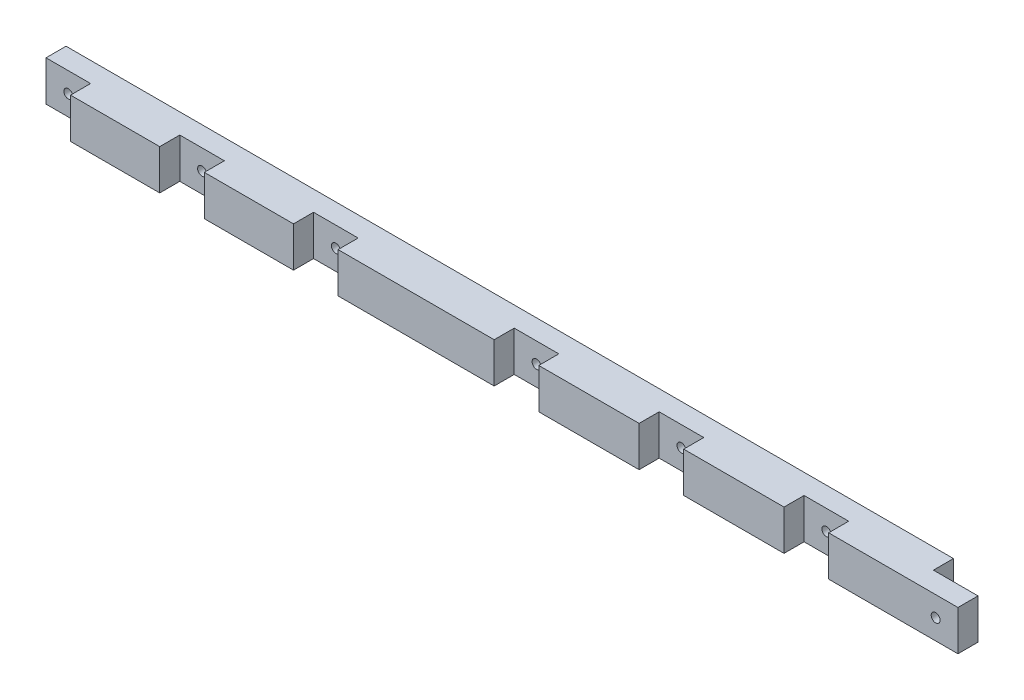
from build123d import *

# Parameters (mm, degrees)
ESQUISSE1_W              = 209
ESQUISSE1_H              = 9
EXTRUSION1_DEPTH         = 9
ESQUISSE2_W              = 10
ESQUISSE2_H              = 9
ENL_V_MAT_EXTRU_1_DEPTH  = 4.5
ESQUISSE3_R              = 1
ENL_V_MAT_EXTRU_2_DEPTH  = 4.5
ESQUISSE4_W              = 10
ESQUISSE4_H              = 9
ENL_V_MAT_EXTRU_4_DEPTH  = 4.5
ESQUISSE6_R              = 1
ENL_V_MAT_EXTRU_5_DEPTH  = 4.5
ESQUISSE7_W              = 10
ESQUISSE7_H              = 9
ENL_V_MAT_EXTRU_6_DEPTH  = 4.5
ESQUISSE8_R              = 1
ENL_V_MAT_EXTRU_7_DEPTH  = 4.5
ESQUISSE9_W              = 10
ESQUISSE9_H              = 9
ENL_V_MAT_EXTRU_8_DEPTH  = 4.5
ESQUISSE10_R             = 1
ENL_V_MAT_EXTRU_9_DEPTH  = 4.5
ESQUISSE11_W             = 10
ESQUISSE11_H             = 9
ENL_V_MAT_EXTRU_10_DEPTH = 4.5
ESQUISSE12_R             = 1
ENL_V_MAT_EXTRU_11_DEPTH = 4.5
ESQUISSE13_W             = 10
ESQUISSE13_H             = 9
ENL_V_MAT_EXTRU_12_DEPTH = 4.5
ESQUISSE14_R             = 1
ENL_V_MAT_EXTRU_13_DEPTH = 4.5
ESQUISSE15_W             = 10
ESQUISSE15_H             = 9
ENL_V_MAT_EXTRU_14_DEPTH = 4.5
ESQUISSE16_R             = 1
ENL_V_MAT_EXTRU_15_DEPTH = 4.5


with BuildPart() as part:
    # Esquisse1 → Extrusion1 (new body)
    with BuildSketch(Plane.XY):
        with Locations((104.5, 4.5)):
            Rectangle(ESQUISSE1_W, ESQUISSE1_H)
    extrude(amount=EXTRUSION1_DEPTH)

    # Esquisse2 → Enl_v. mat.-Extru.1 (cut)
    with BuildSketch(Plane.XY.offset(9)):
        with Locations((5, 4.5)):
            Rectangle(ESQUISSE2_W, ESQUISSE2_H)
    extrude(amount=-ENL_V_MAT_EXTRU_1_DEPTH, mode=Mode.SUBTRACT)

    # Esquisse3 → Enl_v. mat.-Extru.2 (cut)
    with BuildSketch(Plane.XY.offset(4.5)):
        with Locations((5, 4.5)):
            Circle(ESQUISSE3_R)
    extrude(amount=-ENL_V_MAT_EXTRU_2_DEPTH, mode=Mode.SUBTRACT)

    # Esquisse4 → Enl_v. mat.-Extru.4 (cut)
    with BuildSketch(Plane.XY.offset(9)):
        with Locations((35, 4.5)):
            Rectangle(ESQUISSE4_W, ESQUISSE4_H)
    extrude(amount=-ENL_V_MAT_EXTRU_4_DEPTH, mode=Mode.SUBTRACT)

    # Esquisse6 → Enl_v. mat.-Extru.5 (cut)
    with BuildSketch(Plane.XY.offset(4.5)):
        with Locations((35, 4.5)):
            Circle(ESQUISSE6_R)
    extrude(amount=-ENL_V_MAT_EXTRU_5_DEPTH, mode=Mode.SUBTRACT)

    # Esquisse7 → Enl_v. mat.-Extru.6 (cut)
    with BuildSketch(Plane.XY.offset(9)):
        with Locations((65, 4.5)):
            Rectangle(ESQUISSE7_W, ESQUISSE7_H)
    extrude(amount=-ENL_V_MAT_EXTRU_6_DEPTH, mode=Mode.SUBTRACT)

    # Esquisse8 → Enl_v. mat.-Extru.7 (cut)
    with BuildSketch(Plane.XY.offset(4.5)):
        with Locations((65, 4.5)):
            Circle(ESQUISSE8_R)
    extrude(amount=-ENL_V_MAT_EXTRU_7_DEPTH, mode=Mode.SUBTRACT)

    # Esquisse9 → Enl_v. mat.-Extru.8 (cut)
    with BuildSketch(Plane.XY.offset(9)):
        with Locations((110, 4.5)):
            Rectangle(ESQUISSE9_W, ESQUISSE9_H)
    extrude(amount=-ENL_V_MAT_EXTRU_8_DEPTH, mode=Mode.SUBTRACT)

    # Esquisse10 → Enl_v. mat.-Extru.9 (cut)
    with BuildSketch(Plane.XY.offset(4.5)):
        with Locations((110, 4.5)):
            Circle(ESQUISSE10_R)
    extrude(amount=-ENL_V_MAT_EXTRU_9_DEPTH, mode=Mode.SUBTRACT)

    # Esquisse11 → Enl_v. mat.-Extru.10 (cut)
    with BuildSketch(Plane.XY.offset(9)):
        with Locations((142.5, 4.5)):
            Rectangle(ESQUISSE11_W, ESQUISSE11_H)
    extrude(amount=-ENL_V_MAT_EXTRU_10_DEPTH, mode=Mode.SUBTRACT)

    # Esquisse12 → Enl_v. mat.-Extru.11 (cut)
    with BuildSketch(Plane.XY.offset(4.5)):
        with Locations((142.5, 4.5)):
            Circle(ESQUISSE12_R)
    extrude(amount=-ENL_V_MAT_EXTRU_11_DEPTH, mode=Mode.SUBTRACT)

    # Esquisse13 → Enl_v. mat.-Extru.12 (cut)
    with BuildSketch(Plane.XY.offset(9)):
        with Locations((175, 4.5)):
            Rectangle(ESQUISSE13_W, ESQUISSE13_H)
    extrude(amount=-ENL_V_MAT_EXTRU_12_DEPTH, mode=Mode.SUBTRACT)

    # Esquisse14 → Enl_v. mat.-Extru.13 (cut)
    with BuildSketch(Plane.XY.offset(4.5)):
        with Locations((175, 4.5)):
            Circle(ESQUISSE14_R)
    extrude(amount=-ENL_V_MAT_EXTRU_13_DEPTH, mode=Mode.SUBTRACT)

    # Esquisse15 → Enl_v. mat.-Extru.14 (cut)
    with BuildSketch(Plane(origin=(0, 0, 0), x_dir=(-1, 0, 0), z_dir=(0, 0, -1))):
        with Locations((-204, 4.5)):
            Rectangle(ESQUISSE15_W, ESQUISSE15_H)
    extrude(amount=-ENL_V_MAT_EXTRU_14_DEPTH, mode=Mode.SUBTRACT)

    # Esquisse16 → Enl_v. mat.-Extru.15 (cut)
    with BuildSketch(Plane(origin=(0, 0, 4.5), x_dir=(-1, 0, 0), z_dir=(0, 0, -1))):
        with Locations((-204, 4.5)):
            Circle(ESQUISSE16_R)
    extrude(amount=-ENL_V_MAT_EXTRU_15_DEPTH, mode=Mode.SUBTRACT)


solid = part.part
